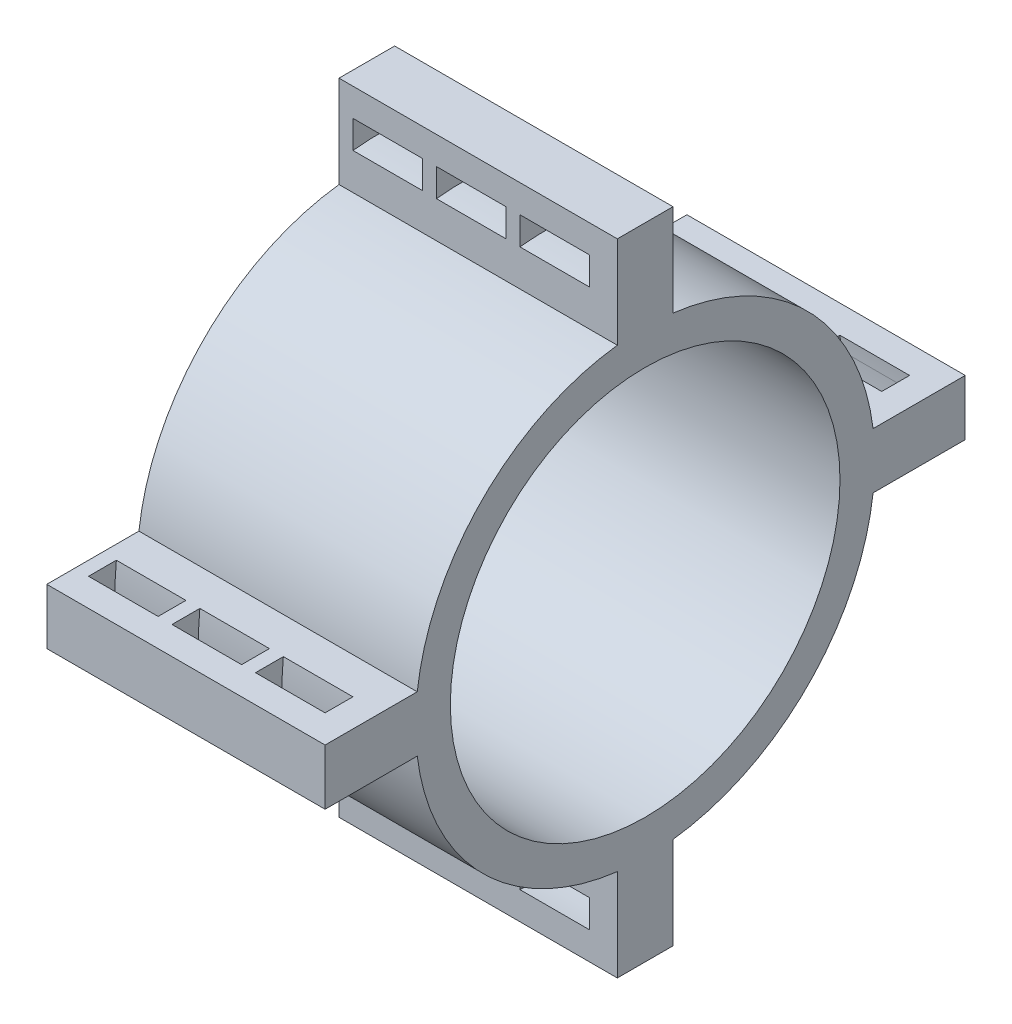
from build123d import *

# Parameters (mm, degrees)
SKETCH_2_R      = 14
EXTRUDE_1_DEPTH = 20
SKETCH_3_W      = 5
SKETCH_3_H      = 2


with BuildPart() as part:
    # Sketch 2 → Extrude 1 (new body)
    with BuildSketch(Plane(origin=(0, 0, 0), x_dir=(0, 0, -1), z_dir=(1, 0, 0))):
        with BuildLine():
            Line((-2, 23), (2, 23))
            Line((2, 23), (2, 16.378339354))
            ThreePointArc((2, 16.378339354), (11.66726189, 11.66726189), (16.378339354, 2))
            Line((16.378339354, 2), (23, 2))
            Line((23, 2), (23, -2))
            Line((23, -2), (16.378339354, -2))
            ThreePointArc((16.378339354, -2), (11.66726189, -11.66726189), (2, -16.378339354))
            Line((2, -16.378339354), (2, -23))
            Line((2, -23), (-2, -23))
            Line((-2, -23), (-2, -16.378339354))
            ThreePointArc((-2, -16.378339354), (-11.66726189, -11.66726189), (-16.378339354, -2))
            Line((-16.378339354, -2), (-23, -2))
            Line((-23, -2), (-23, 2))
            Line((-23, 2), (-16.378339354, 2))
            ThreePointArc((-16.378339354, 2), (-11.66726189, 11.66726189), (-2, 16.378339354))
            Line((-2, 16.378339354), (-2, 23))
        make_face()
        Circle(SKETCH_2_R, mode=Mode.SUBTRACT)
    extrude(amount=EXTRUDE_1_DEPTH)

    # Sweep 1: sweep along a curve in space
    with BuildLine() as sweep_1_path:
        ThreePointArc((20, 0, -14), (20, 9.899494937, -9.899494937), (20, 14, 0))
        ThreePointArc((20, 14, 0), (20, 9.899494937, 9.899494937), (20, 0, 14))
        ThreePointArc((20, 0, 14), (20, -9.899494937, 9.899494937), (20, -14, 0))
        ThreePointArc((20, -14, 0), (20, -9.899494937, -9.899494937), (20, 0, -14))
    # Sketch 3 → Sweep 1 (sweep, cut)
    with BuildSketch(Plane.XY.offset(2)):
        with Locations((15.5, -20)):
            Rectangle(SKETCH_3_W, SKETCH_3_H)
        with Locations((9.5, -20)):
            Rectangle(SKETCH_3_W, SKETCH_3_H)
        with Locations((3.5, -20)):
            Rectangle(SKETCH_3_W, SKETCH_3_H)
    sweep(path=sweep_1_path.line, mode=Mode.SUBTRACT)


solid = part.part
